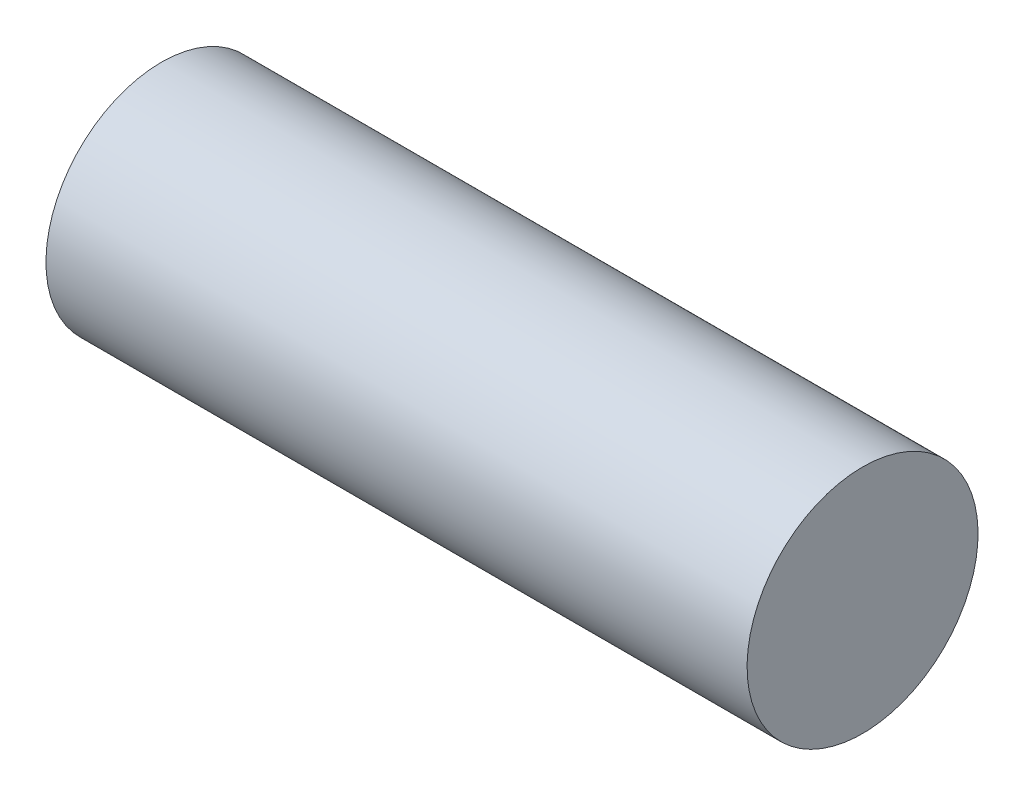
ISO-10303-21;
HEADER;
FILE_DESCRIPTION(('STEP AP214'),'2;1');
FILE_NAME('part.step','',(''),(''),'','','');
FILE_SCHEMA(('AUTOMOTIVE_DESIGN { 1 0 10303 214 1 1 1 1 }'));
ENDSEC;
DATA;
#1=APPLICATION_CONTEXT('core data for automotive mechanical design processes');
#2=APPLICATION_PROTOCOL_DEFINITION('international standard','automotive_design',2000,#1);
#3=PRODUCT_CONTEXT('',#1,'mechanical');
#4=PRODUCT('Part','Part','',(#3));
#5=PRODUCT_RELATED_PRODUCT_CATEGORY('part','',(#4));
#6=PRODUCT_DEFINITION_FORMATION('','',#4);
#7=PRODUCT_DEFINITION_CONTEXT('part definition',#1,'design');
#8=PRODUCT_DEFINITION('design','',#6,#7);
#9=PRODUCT_DEFINITION_SHAPE('','',#8);
#10=(LENGTH_UNIT() NAMED_UNIT(*) SI_UNIT(.MILLI.,.METRE.));
#11=(NAMED_UNIT(*) PLANE_ANGLE_UNIT() SI_UNIT($,.RADIAN.));
#12=(NAMED_UNIT(*) SI_UNIT($,.STERADIAN.) SOLID_ANGLE_UNIT());
#13=UNCERTAINTY_MEASURE_WITH_UNIT(LENGTH_MEASURE(1.E-05),#10,'distance_accuracy_value','');
#14=(GEOMETRIC_REPRESENTATION_CONTEXT(3) GLOBAL_UNCERTAINTY_ASSIGNED_CONTEXT((#13)) GLOBAL_UNIT_ASSIGNED_CONTEXT((#10,
#11,#12)) REPRESENTATION_CONTEXT('',''));
#15=CARTESIAN_POINT('',(0.,0.,0.));
#16=DIRECTION('',(0.,0.,1.));
#17=DIRECTION('',(1.,0.,0.));
#18=AXIS2_PLACEMENT_3D('',#15,#16,#17);
#19=CARTESIAN_POINT('',(-255.,0.,0.));
#20=DIRECTION('',(-1.,0.,0.));
#21=DIRECTION('',(0.,-1.,0.));
#22=AXIS2_PLACEMENT_3D('',#19,#20,#21);
#23=PLANE('',#22);
#24=CARTESIAN_POINT('',(-255.,0.,0.));
#25=DIRECTION('',(1.,0.,0.));
#26=DIRECTION('',(0.,1.,0.));
#27=AXIS2_PLACEMENT_3D('',#24,#25,#26);
#28=CIRCLE('',#27,42.);
#29=CARTESIAN_POINT('',(-255.,42.,0.));
#30=VERTEX_POINT('',#29);
#31=EDGE_CURVE('E10',#30,#30,#28,.T.);
#32=ORIENTED_EDGE('',*,*,#31,.F.);
#33=EDGE_LOOP('',(#32));
#34=FACE_BOUND('',#33,.T.);
#35=ADVANCED_FACE('F30',(#34),#23,.T.);
#36=CARTESIAN_POINT('',(0.,0.,0.));
#37=DIRECTION('',(1.,0.,0.));
#38=DIRECTION('',(0.,1.,0.));
#39=AXIS2_PLACEMENT_3D('',#36,#37,#38);
#40=CYLINDRICAL_SURFACE('',#39,42.);
#41=ORIENTED_EDGE('',*,*,#31,.T.);
#42=EDGE_LOOP('',(#41));
#43=FACE_BOUND('',#42,.T.);
#44=CARTESIAN_POINT('',(0.,0.,0.));
#45=DIRECTION('',(1.,0.,0.));
#46=DIRECTION('',(0.,1.,0.));
#47=AXIS2_PLACEMENT_3D('',#44,#45,#46);
#48=CIRCLE('',#47,42.);
#49=CARTESIAN_POINT('',(0.,42.,0.));
#50=VERTEX_POINT('',#49);
#51=EDGE_CURVE('E36',#50,#50,#48,.T.);
#52=ORIENTED_EDGE('',*,*,#51,.F.);
#53=EDGE_LOOP('',(#52));
#54=FACE_BOUND('',#53,.T.);
#55=ADVANCED_FACE('F44',(#43,#54),#40,.T.);
#56=CARTESIAN_POINT('',(0.,42.,0.));
#57=DIRECTION('',(1.,0.,0.));
#58=DIRECTION('',(0.,1.,0.));
#59=AXIS2_PLACEMENT_3D('',#56,#57,#58);
#60=PLANE('',#59);
#61=ORIENTED_EDGE('',*,*,#51,.T.);
#62=EDGE_LOOP('',(#61));
#63=FACE_BOUND('',#62,.T.);
#64=ADVANCED_FACE('F42',(#63),#60,.T.);
#65=CLOSED_SHELL('',(#35,#55,#64));
#66=MANIFOLD_SOLID_BREP('B2',#65);
#67=ADVANCED_BREP_SHAPE_REPRESENTATION('',(#18,#66),#14);
#68=SHAPE_DEFINITION_REPRESENTATION(#9,#67);
ENDSEC;
END-ISO-10303-21;
